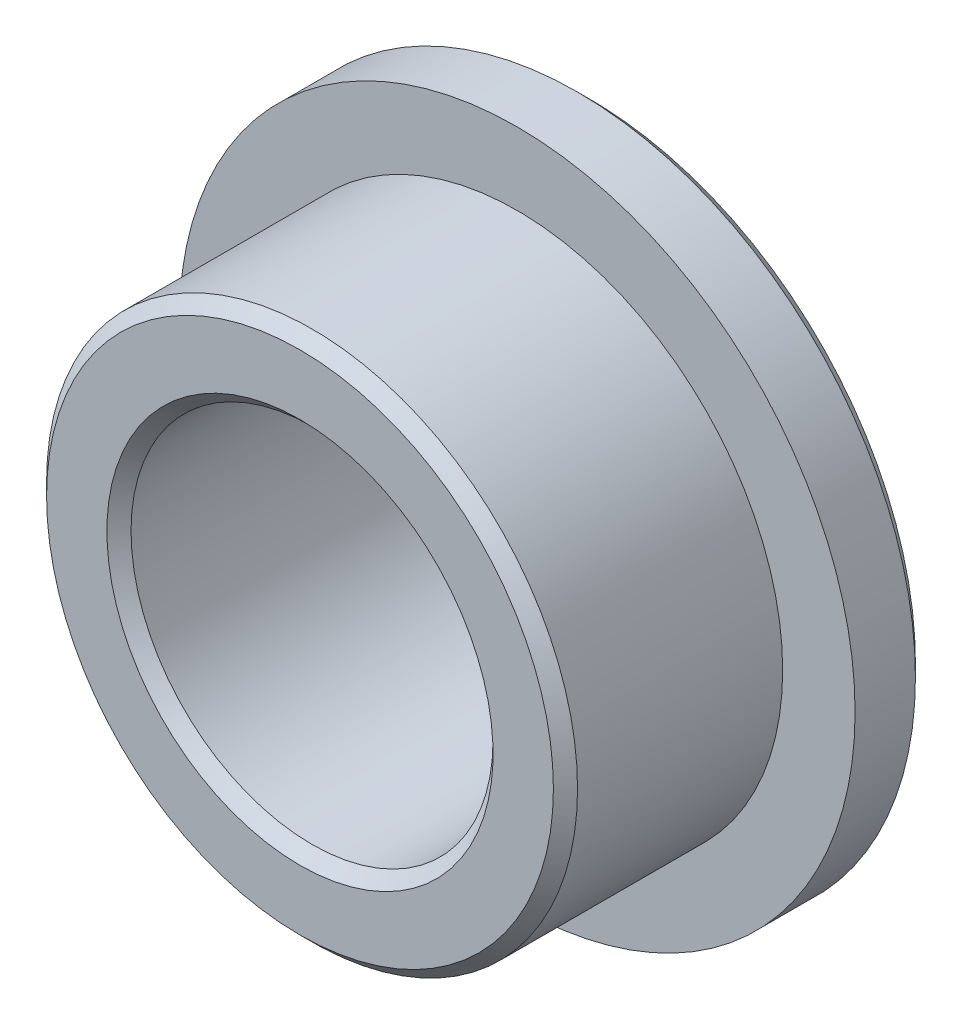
ISO-10303-21;
HEADER;
FILE_DESCRIPTION(('STEP AP214'),'2;1');
FILE_NAME('part.step','',(''),(''),'','','');
FILE_SCHEMA(('AUTOMOTIVE_DESIGN { 1 0 10303 214 1 1 1 1 }'));
ENDSEC;
DATA;
#1=APPLICATION_CONTEXT('core data for automotive mechanical design processes');
#2=APPLICATION_PROTOCOL_DEFINITION('international standard','automotive_design',2000,#1);
#3=PRODUCT_CONTEXT('',#1,'mechanical');
#4=PRODUCT('Part','Part','',(#3));
#5=PRODUCT_RELATED_PRODUCT_CATEGORY('part','',(#4));
#6=PRODUCT_DEFINITION_FORMATION('','',#4);
#7=PRODUCT_DEFINITION_CONTEXT('part definition',#1,'design');
#8=PRODUCT_DEFINITION('design','',#6,#7);
#9=PRODUCT_DEFINITION_SHAPE('','',#8);
#10=(LENGTH_UNIT() NAMED_UNIT(*) SI_UNIT(.MILLI.,.METRE.));
#11=(NAMED_UNIT(*) PLANE_ANGLE_UNIT() SI_UNIT($,.RADIAN.));
#12=(NAMED_UNIT(*) SI_UNIT($,.STERADIAN.) SOLID_ANGLE_UNIT());
#13=UNCERTAINTY_MEASURE_WITH_UNIT(LENGTH_MEASURE(1.E-05),#10,'distance_accuracy_value','');
#14=(GEOMETRIC_REPRESENTATION_CONTEXT(3) GLOBAL_UNCERTAINTY_ASSIGNED_CONTEXT((#13)) GLOBAL_UNIT_ASSIGNED_CONTEXT((#10,
#11,#12)) REPRESENTATION_CONTEXT('',''));
#15=CARTESIAN_POINT('',(0.,0.,0.));
#16=DIRECTION('',(0.,0.,1.));
#17=DIRECTION('',(1.,0.,0.));
#18=AXIS2_PLACEMENT_3D('',#15,#16,#17);
#19=CARTESIAN_POINT('',(-29.9999999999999,1.155826E-13,-12.0000000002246));
#20=DIRECTION('',(0.,0.,-1.));
#21=DIRECTION('',(0.,1.,0.));
#22=AXIS2_PLACEMENT_3D('',#19,#20,#21);
#23=CONICAL_SURFACE('',#22,7.99999999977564,0.785398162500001);
#24=CARTESIAN_POINT('',(-29.9999999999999,1.155826E-13,-12.0000000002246));
#25=DIRECTION('',(0.,0.,-1.));
#26=DIRECTION('',(0.,1.,0.));
#27=AXIS2_PLACEMENT_3D('',#24,#25,#26);
#28=CIRCLE('',#27,7.99999999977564);
#29=CARTESIAN_POINT('',(-29.9999999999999,7.99999999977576,-12.0000000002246));
#30=VERTEX_POINT('',#29);
#31=EDGE_CURVE('E17',#30,#30,#28,.F.);
#32=ORIENTED_EDGE('',*,*,#31,.F.);
#33=EDGE_LOOP('',(#32));
#34=FACE_BOUND('',#33,.T.);
#35=CARTESIAN_POINT('',(-29.9999999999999,1.1673327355E-13,-11.5000000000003));
#36=DIRECTION('',(0.,0.,-1.));
#37=DIRECTION('',(0.,1.,0.));
#38=AXIS2_PLACEMENT_3D('',#35,#36,#37);
#39=CIRCLE('',#38,7.49999999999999);
#40=CARTESIAN_POINT('',(-29.9999999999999,7.50000000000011,-11.5000000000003));
#41=VERTEX_POINT('',#40);
#42=EDGE_CURVE('E61',#41,#41,#39,.F.);
#43=ORIENTED_EDGE('',*,*,#42,.T.);
#44=EDGE_LOOP('',(#43));
#45=FACE_BOUND('',#44,.T.);
#46=ADVANCED_FACE('F14',(#34,#45),#23,.F.);
#47=CARTESIAN_POINT('',(-29.9999999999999,1.158275E-13,-6.00000000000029));
#48=DIRECTION('',(0.,0.,-1.));
#49=DIRECTION('',(0.,1.,0.));
#50=AXIS2_PLACEMENT_3D('',#47,#48,#49);
#51=CYLINDRICAL_SURFACE('',#50,7.49999999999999);
#52=ORIENTED_EDGE('',*,*,#42,.F.);
#53=EDGE_LOOP('',(#52));
#54=FACE_BOUND('',#53,.T.);
#55=CARTESIAN_POINT('',(-29.9999999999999,1.142354E-13,-0.500000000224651));
#56=DIRECTION('',(0.,0.,1.));
#57=DIRECTION('',(1.,0.,0.));
#58=AXIS2_PLACEMENT_3D('',#55,#56,#57);
#59=CIRCLE('',#58,7.50000000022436);
#60=CARTESIAN_POINT('',(-22.4999999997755,1.142354E-13,-0.50000000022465));
#61=VERTEX_POINT('',#60);
#62=EDGE_CURVE('E51',#61,#61,#59,.T.);
#63=ORIENTED_EDGE('',*,*,#62,.T.);
#64=EDGE_LOOP('',(#63));
#65=FACE_BOUND('',#64,.T.);
#66=ADVANCED_FACE('F71',(#54,#65),#51,.F.);
#67=CARTESIAN_POINT('',(-29.9999999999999,13.5000000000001,-12.0000000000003));
#68=DIRECTION('',(0.,0.,-1.));
#69=DIRECTION('',(-1.,0.,0.));
#70=AXIS2_PLACEMENT_3D('',#67,#68,#69);
#71=PLANE('',#70);
#72=ORIENTED_EDGE('',*,*,#31,.T.);
#73=EDGE_LOOP('',(#72));
#74=FACE_BOUND('',#73,.T.);
#75=CARTESIAN_POINT('',(-29.9999999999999,1.136868E-13,-12.0000000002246));
#76=DIRECTION('',(0.,0.,1.));
#77=DIRECTION('',(1.,0.,0.));
#78=AXIS2_PLACEMENT_3D('',#75,#76,#77);
#79=CIRCLE('',#78,13.5000000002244);
#80=CARTESIAN_POINT('',(-16.4999999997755,1.136868E-13,-12.0000000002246));
#81=VERTEX_POINT('',#80);
#82=EDGE_CURVE('E48',#81,#81,#79,.T.);
#83=ORIENTED_EDGE('',*,*,#82,.F.);
#84=EDGE_LOOP('',(#83));
#85=FACE_BOUND('',#84,.T.);
#86=ADVANCED_FACE('F73',(#74,#85),#71,.T.);
#87=CARTESIAN_POINT('',(-29.9999999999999,1.142354E-13,2.24075424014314E-10));
#88=DIRECTION('',(0.,0.,1.));
#89=DIRECTION('',(0.,-1.,0.));
#90=AXIS2_PLACEMENT_3D('',#87,#88,#89);
#91=CONICAL_SURFACE('',#90,7.99999999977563,0.785398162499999);
#92=CARTESIAN_POINT('',(-29.9999999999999,1.142354E-13,2.24076399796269E-10));
#93=DIRECTION('',(0.,0.,1.));
#94=DIRECTION('',(0.,-1.,0.));
#95=AXIS2_PLACEMENT_3D('',#92,#93,#94);
#96=CIRCLE('',#95,7.99999999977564);
#97=CARTESIAN_POINT('',(-29.9999999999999,-7.99999999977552,2.24076399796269E-10));
#98=VERTEX_POINT('',#97);
#99=EDGE_CURVE('E45',#98,#98,#96,.F.);
#100=ORIENTED_EDGE('',*,*,#99,.F.);
#101=EDGE_LOOP('',(#100));
#102=FACE_BOUND('',#101,.T.);
#103=ORIENTED_EDGE('',*,*,#62,.F.);
#104=EDGE_LOOP('',(#103));
#105=FACE_BOUND('',#104,.T.);
#106=ADVANCED_FACE('F79',(#102,#105),#91,.F.);
#107=CARTESIAN_POINT('',(-29.9999999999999,1.136868E-13,-11.4999999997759));
#108=DIRECTION('',(0.,0.,1.));
#109=DIRECTION('',(1.,0.,0.));
#110=AXIS2_PLACEMENT_3D('',#107,#108,#109);
#111=CONICAL_SURFACE('',#110,13.9999999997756,0.7853981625);
#112=CARTESIAN_POINT('',(-29.9999999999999,1.119723E-13,-11.5000000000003));
#113=DIRECTION('',(0.,0.,1.));
#114=DIRECTION('',(1.,0.,0.));
#115=AXIS2_PLACEMENT_3D('',#112,#113,#114);
#116=CIRCLE('',#115,14.);
#117=CARTESIAN_POINT('',(-15.9999999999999,1.119723E-13,-11.5000000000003));
#118=VERTEX_POINT('',#117);
#119=EDGE_CURVE('E44',#118,#118,#116,.T.);
#120=ORIENTED_EDGE('',*,*,#119,.F.);
#121=EDGE_LOOP('',(#120));
#122=FACE_BOUND('',#121,.T.);
#123=ORIENTED_EDGE('',*,*,#82,.T.);
#124=EDGE_LOOP('',(#123));
#125=FACE_BOUND('',#124,.T.);
#126=ADVANCED_FACE('F104',(#122,#125),#111,.T.);
#127=CARTESIAN_POINT('',(-29.9999999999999,10.5000000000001,-2.842171E-13));
#128=DIRECTION('',(0.,0.,1.));
#129=DIRECTION('',(1.,0.,0.));
#130=AXIS2_PLACEMENT_3D('',#127,#128,#129);
#131=PLANE('',#130);
#132=ORIENTED_EDGE('',*,*,#99,.T.);
#133=EDGE_LOOP('',(#132));
#134=FACE_BOUND('',#133,.T.);
#135=CARTESIAN_POINT('',(-29.9999999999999,1.136868E-13,2.24072930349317E-10));
#136=DIRECTION('',(0.,0.,-1.));
#137=DIRECTION('',(-1.,0.,0.));
#138=AXIS2_PLACEMENT_3D('',#135,#136,#137);
#139=CIRCLE('',#138,10.5000000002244);
#140=CARTESIAN_POINT('',(-40.5000000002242,1.136868E-13,2.24072930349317E-10));
#141=VERTEX_POINT('',#140);
#142=EDGE_CURVE('E40',#141,#141,#139,.T.);
#143=ORIENTED_EDGE('',*,*,#142,.F.);
#144=EDGE_LOOP('',(#143));
#145=FACE_BOUND('',#144,.T.);
#146=ADVANCED_FACE('F100',(#134,#145),#131,.T.);
#147=CARTESIAN_POINT('',(-29.9999999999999,1.119723E-13,-10.2500000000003));
#148=DIRECTION('',(0.,0.,1.));
#149=DIRECTION('',(1.,0.,0.));
#150=AXIS2_PLACEMENT_3D('',#147,#148,#149);
#151=CYLINDRICAL_SURFACE('',#150,14.);
#152=ORIENTED_EDGE('',*,*,#119,.T.);
#153=EDGE_LOOP('',(#152));
#154=FACE_BOUND('',#153,.T.);
#155=CARTESIAN_POINT('',(-29.9999999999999,1.119723E-13,-9.00000000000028));
#156=DIRECTION('',(0.,0.,1.));
#157=DIRECTION('',(1.,0.,0.));
#158=AXIS2_PLACEMENT_3D('',#155,#156,#157);
#159=CIRCLE('',#158,14.);
#160=CARTESIAN_POINT('',(-15.9999999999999,1.119723E-13,-9.00000000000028));
#161=VERTEX_POINT('',#160);
#162=EDGE_CURVE('E31',#161,#161,#159,.T.);
#163=ORIENTED_EDGE('',*,*,#162,.F.);
#164=EDGE_LOOP('',(#163));
#165=FACE_BOUND('',#164,.T.);
#166=ADVANCED_FACE('F96',(#154,#165),#151,.T.);
#167=CARTESIAN_POINT('',(-29.9999999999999,1.136868E-13,-0.50000000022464));
#168=DIRECTION('',(0.,0.,-1.));
#169=DIRECTION('',(-1.,0.,0.));
#170=AXIS2_PLACEMENT_3D('',#167,#168,#169);
#171=CONICAL_SURFACE('',#170,10.9999999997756,0.785398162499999);
#172=CARTESIAN_POINT('',(-29.9999999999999,1.123397E-13,-0.500000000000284));
#173=DIRECTION('',(0.,0.,1.));
#174=DIRECTION('',(1.,0.,0.));
#175=AXIS2_PLACEMENT_3D('',#172,#173,#174);
#176=CIRCLE('',#175,11.);
#177=CARTESIAN_POINT('',(-18.9999999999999,1.123397E-13,-0.500000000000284));
#178=VERTEX_POINT('',#177);
#179=EDGE_CURVE('E22',#178,#178,#176,.F.);
#180=ORIENTED_EDGE('',*,*,#179,.F.);
#181=EDGE_LOOP('',(#180));
#182=FACE_BOUND('',#181,.T.);
#183=ORIENTED_EDGE('',*,*,#142,.T.);
#184=EDGE_LOOP('',(#183));
#185=FACE_BOUND('',#184,.T.);
#186=ADVANCED_FACE('F89',(#182,#185),#171,.T.);
#187=CARTESIAN_POINT('',(-29.9999999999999,14.0000000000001,-9.00000000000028));
#188=DIRECTION('',(0.,0.,1.));
#189=DIRECTION('',(1.,0.,0.));
#190=AXIS2_PLACEMENT_3D('',#187,#188,#189);
#191=PLANE('',#190);
#192=CARTESIAN_POINT('',(-29.9999999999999,1.123397E-13,-9.00000000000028));
#193=DIRECTION('',(0.,0.,1.));
#194=DIRECTION('',(1.,0.,0.));
#195=AXIS2_PLACEMENT_3D('',#192,#193,#194);
#196=CIRCLE('',#195,11.);
#197=CARTESIAN_POINT('',(-18.9999999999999,1.123397E-13,-9.00000000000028));
#198=VERTEX_POINT('',#197);
#199=EDGE_CURVE('E10',#198,#198,#196,.T.);
#200=ORIENTED_EDGE('',*,*,#199,.F.);
#201=EDGE_LOOP('',(#200));
#202=FACE_BOUND('',#201,.T.);
#203=ORIENTED_EDGE('',*,*,#162,.T.);
#204=EDGE_LOOP('',(#203));
#205=FACE_BOUND('',#204,.T.);
#206=ADVANCED_FACE('F85',(#202,#205),#191,.T.);
#207=CARTESIAN_POINT('',(-29.9999999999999,1.123397E-13,-4.75000000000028));
#208=DIRECTION('',(0.,0.,1.));
#209=DIRECTION('',(1.,0.,0.));
#210=AXIS2_PLACEMENT_3D('',#207,#208,#209);
#211=CYLINDRICAL_SURFACE('',#210,11.);
#212=ORIENTED_EDGE('',*,*,#199,.T.);
#213=EDGE_LOOP('',(#212));
#214=FACE_BOUND('',#213,.T.);
#215=ORIENTED_EDGE('',*,*,#179,.T.);
#216=EDGE_LOOP('',(#215));
#217=FACE_BOUND('',#216,.T.);
#218=ADVANCED_FACE('F83',(#214,#217),#211,.T.);
#219=CLOSED_SHELL('',(#46,#66,#86,#106,#126,#146,#166,#186,#206,#218));
#220=MANIFOLD_SOLID_BREP('B1',#219);
#221=ADVANCED_BREP_SHAPE_REPRESENTATION('',(#18,#220),#14);
#222=SHAPE_DEFINITION_REPRESENTATION(#9,#221);
ENDSEC;
END-ISO-10303-21;
